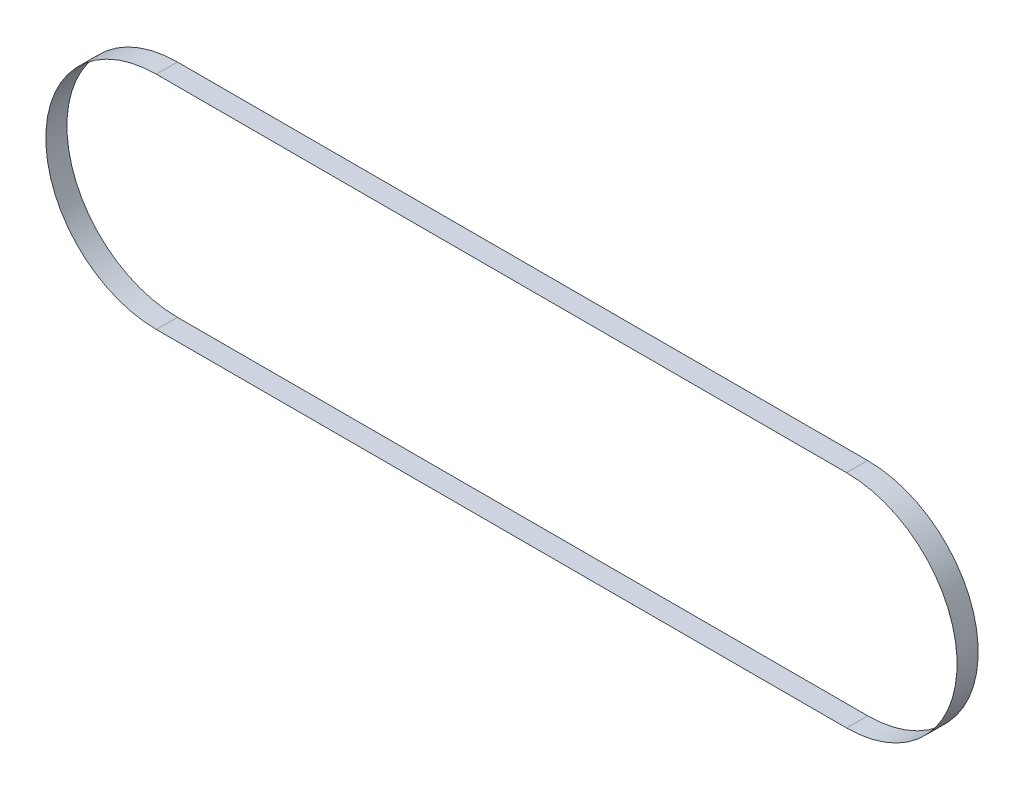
from build123d import *

# Parameters (mm, degrees)
LINEAR_AUSTRAGEN_D_NN1_DEPTH = 3.875


with BuildPart() as part:
    # Skizze2 → Linear-Austragen-D_nn1 (new, symmetric)
    with BuildSketch(Plane.XY):
        with BuildLine():
            Line((0, 40.59505), (253.47, 40.59505))
            ThreePointArc((253.47, 40.59505), (294.06505, 0), (253.47, -40.59505))
            Line((253.47, -40.59505), (0, -40.59505))
            ThreePointArc((0, -40.59505), (-40.59505, 0), (0, 40.59505))
        make_face()
        with BuildLine():
            Line((0, 40.59495), (253.47, 40.59495))
            ThreePointArc((253.47, 40.59495), (294.06495, 0), (253.47, -40.59495))
            Line((253.47, -40.59495), (0, -40.59495))
            ThreePointArc((0, -40.59495), (-40.59495, 0), (0, 40.59495))
        make_face(mode=Mode.SUBTRACT)
    extrude(amount=LINEAR_AUSTRAGEN_D_NN1_DEPTH, both=True)


solid = part.part
